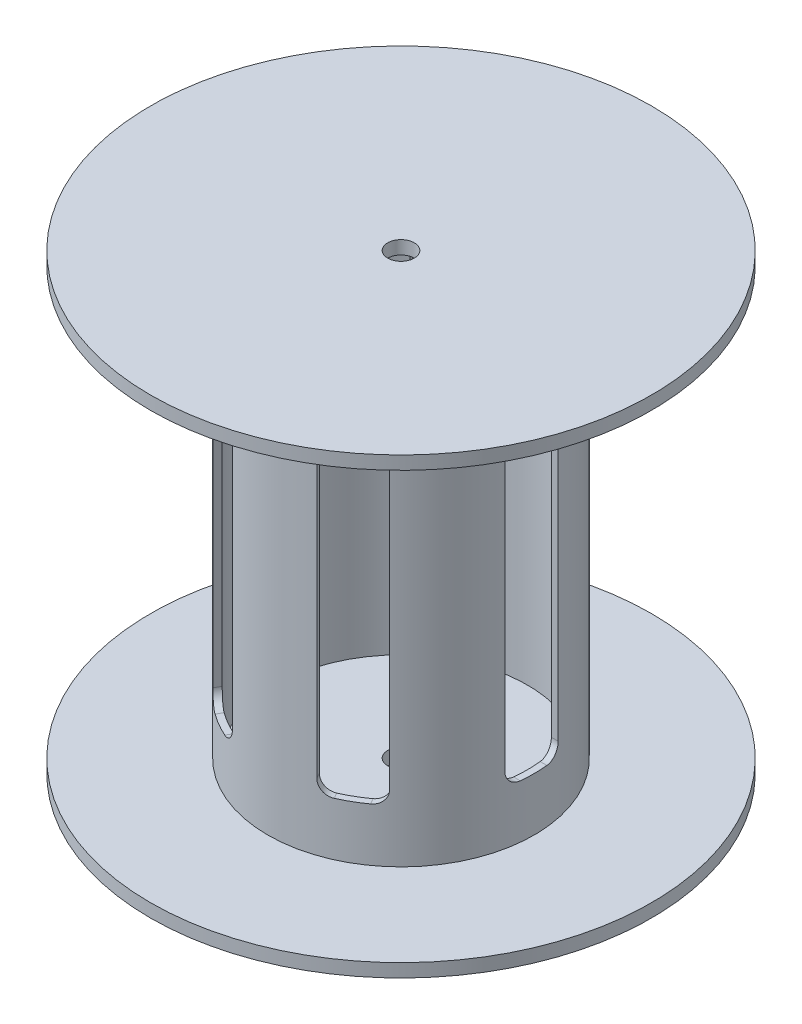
from build123d import *

# Parameters (mm, degrees)
SKETCH2_R           = 59.69
BOSS_EXTRUDE1_DEPTH = 3.175
SKETCH3_R           = 31.75
SKETCH3_R_2         = 30.1625
BOSS_EXTRUDE2_DEPTH = 101.6
SKETCH4_R           = 59.69
BOSS_EXTRUDE3_DEPTH = 3.175
CUT_EXTRUDE1_START  = -107.95
SKETCH5_R           = 3.175
CUT_EXTRUDE1_DEPTH  = 107.95
CUT_EXTRUDE2_START  = -31.75
CUT_EXTRUDE2_DEPTH  = 63.5
CIRPATTERN1_COUNT   = 3


with BuildPart() as part:
    # Sketch2 → Boss-Extrude1 (new body)
    with BuildSketch(Plane(origin=(0, 0, 0), x_dir=(1, 0, 0), z_dir=(0, 1, 0))):
        with Locations(Location((0, 0, 0), (0, 0, 270))):
            Circle(SKETCH2_R)
    extrude(amount=BOSS_EXTRUDE1_DEPTH)

    # Sketch3 → Boss-Extrude2 (add)
    with BuildSketch(Plane(origin=(0, 3.175, 0), x_dir=(1, 0, 0), z_dir=(0, 1, 0))):
        with Locations(Location((0, 0, 0), (0, 0, 270))):
            Circle(SKETCH3_R)
        with Locations(Location((0, 0, 0), (0, 0, 270))):
            Circle(SKETCH3_R_2, mode=Mode.SUBTRACT)
    extrude(amount=BOSS_EXTRUDE2_DEPTH)

    # Sketch4 → Boss-Extrude3 (add)
    with BuildSketch(Plane(origin=(0, 104.775, 0), x_dir=(1, 0, 0), z_dir=(0, 1, 0))):
        with Locations(Location((0, 0, 0), (0, 0, 270))):
            Circle(SKETCH4_R)
    extrude(amount=BOSS_EXTRUDE3_DEPTH)

    # Sketch5 → Cut-Extrude1 (cut)
    with BuildSketch(Plane(origin=(0, 107.95, 0), x_dir=(1, 0, 0), z_dir=(0, 1, 0)).offset(CUT_EXTRUDE1_START)):
        with Locations(Location((0, 0, 0), (0, 0, 270))):
            Circle(SKETCH5_R)
    extrude(amount=CUT_EXTRUDE1_DEPTH, mode=Mode.SUBTRACT)

    # Sketch6 → Cut-Extrude2 (cut)
    with BuildSketch(Plane(origin=(0, 0, 0), x_dir=(0, 0, -1), z_dir=(1, 0, 0)).offset(CUT_EXTRUDE2_START)):
        with BuildLine():
            Line((-3.175, 92.075), (3.175, 92.075))
            ThreePointArc((3.175, 92.075), (5.42006403, 91.14506403), (6.35, 88.9))
            Line((6.35, 88.9), (6.35, 19.05))
            ThreePointArc((6.35, 19.05), (5.42006403, 16.80493597), (3.175, 15.875))
            Line((3.175, 15.875), (-3.175, 15.875))
            ThreePointArc((-3.175, 15.875), (-5.42006403, 16.80493597), (-6.35, 19.05))
            Line((-6.35, 19.05), (-6.35, 88.9))
            ThreePointArc((-6.35, 88.9), (-5.42006403, 91.14506403), (-3.175, 92.075))
        make_face()
    cut_extrude2 = extrude(amount=CUT_EXTRUDE2_DEPTH, mode=Mode.SUBTRACT)

    # CirPattern1: Cut-Extrude2 ×3 about axis
    cirpattern1_axis = Axis((0, 0, 0), (0, 1, 0))
    for i in range(1, CIRPATTERN1_COUNT):
        add(cut_extrude2.rotate(cirpattern1_axis, i * 360 / CIRPATTERN1_COUNT), mode=Mode.SUBTRACT)


solid = part.part
